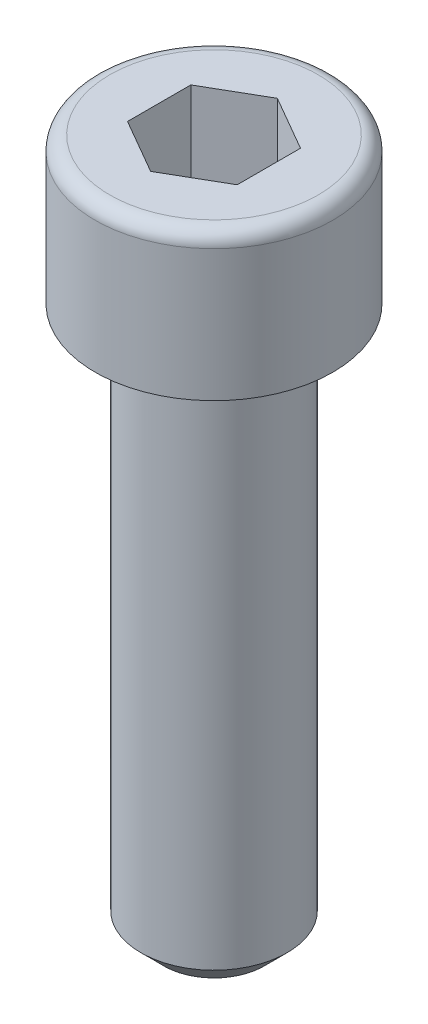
ISO-10303-21;
HEADER;
FILE_DESCRIPTION(('STEP AP214'),'2;1');
FILE_NAME('part.step','',(''),(''),'','','');
FILE_SCHEMA(('AUTOMOTIVE_DESIGN { 1 0 10303 214 1 1 1 1 }'));
ENDSEC;
DATA;
#1=APPLICATION_CONTEXT('core data for automotive mechanical design processes');
#2=APPLICATION_PROTOCOL_DEFINITION('international standard','automotive_design',2000,#1);
#3=PRODUCT_CONTEXT('',#1,'mechanical');
#4=PRODUCT('Part','Part','',(#3));
#5=PRODUCT_RELATED_PRODUCT_CATEGORY('part','',(#4));
#6=PRODUCT_DEFINITION_FORMATION('','',#4);
#7=PRODUCT_DEFINITION_CONTEXT('part definition',#1,'design');
#8=PRODUCT_DEFINITION('design','',#6,#7);
#9=PRODUCT_DEFINITION_SHAPE('','',#8);
#10=(LENGTH_UNIT() NAMED_UNIT(*) SI_UNIT(.MILLI.,.METRE.));
#11=(NAMED_UNIT(*) PLANE_ANGLE_UNIT() SI_UNIT($,.RADIAN.));
#12=(NAMED_UNIT(*) SI_UNIT($,.STERADIAN.) SOLID_ANGLE_UNIT());
#13=UNCERTAINTY_MEASURE_WITH_UNIT(LENGTH_MEASURE(1.E-05),#10,'distance_accuracy_value','');
#14=(GEOMETRIC_REPRESENTATION_CONTEXT(3) GLOBAL_UNCERTAINTY_ASSIGNED_CONTEXT((#13)) GLOBAL_UNIT_ASSIGNED_CONTEXT((#10,
#11,#12)) REPRESENTATION_CONTEXT('',''));
#15=CARTESIAN_POINT('',(0.,0.,0.));
#16=DIRECTION('',(0.,0.,1.));
#17=DIRECTION('',(1.,0.,0.));
#18=AXIS2_PLACEMENT_3D('',#15,#16,#17);
#19=CARTESIAN_POINT('',(2.75000000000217,-38.,1.17961196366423E-13));
#20=DIRECTION('',(0.,-1.,0.));
#21=DIRECTION('',(1.,0.,0.));
#22=AXIS2_PLACEMENT_3D('',#19,#20,#21);
#23=PLANE('',#22);
#24=CARTESIAN_POINT('',(2.05391259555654E-12,-38.,0.));
#25=DIRECTION('',(0.,1.,0.));
#26=DIRECTION('',(-1.,0.,0.));
#27=AXIS2_PLACEMENT_3D('',#24,#25,#26);
#28=CIRCLE('',#27,2.75);
#29=CARTESIAN_POINT('',(-2.74999999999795,-37.9999999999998,0.));
#30=VERTEX_POINT('',#29);
#31=EDGE_CURVE('E13',#30,#30,#28,.T.);
#32=ORIENTED_EDGE('',*,*,#31,.F.);
#33=EDGE_LOOP('',(#32));
#34=FACE_BOUND('',#33,.T.);
#35=ADVANCED_FACE('F356',(#34),#23,.T.);
#36=CARTESIAN_POINT('',(2.05391259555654E-12,-38.,0.));
#37=DIRECTION('',(0.,1.,0.));
#38=DIRECTION('',(-1.,0.,0.));
#39=AXIS2_PLACEMENT_3D('',#36,#37,#38);
#40=CONICAL_SURFACE('',#39,2.75,0.785398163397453);
#41=CARTESIAN_POINT('',(2.02615701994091E-12,-36.75,1.04083408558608E-13));
#42=DIRECTION('',(0.,1.,0.));
#43=DIRECTION('',(-1.,0.,0.));
#44=AXIS2_PLACEMENT_3D('',#41,#42,#43);
#45=CIRCLE('',#44,4.);
#46=CARTESIAN_POINT('',(-3.99999999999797,-36.7499999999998,1.04083408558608E-13));
#47=VERTEX_POINT('',#46);
#48=EDGE_CURVE('E363',#47,#47,#45,.T.);
#49=ORIENTED_EDGE('',*,*,#48,.F.);
#50=EDGE_LOOP('',(#49));
#51=FACE_BOUND('',#50,.T.);
#52=ORIENTED_EDGE('',*,*,#31,.T.);
#53=EDGE_LOOP('',(#52));
#54=FACE_BOUND('',#53,.T.);
#55=ADVANCED_FACE('F479',(#51,#54),#40,.T.);
#56=CARTESIAN_POINT('',(-3.91353616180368E-12,65.1172922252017,-9.57567358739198E-13));
#57=DIRECTION('',(0.,1.,0.));
#58=DIRECTION('',(-1.,0.,0.));
#59=AXIS2_PLACEMENT_3D('',#56,#57,#58);
#60=CYLINDRICAL_SURFACE('',#59,3.99999999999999);
#61=ORIENTED_EDGE('',*,*,#48,.T.);
#62=EDGE_LOOP('',(#61));
#63=FACE_BOUND('',#62,.T.);
#64=CARTESIAN_POINT('',(2.77555756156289E-13,-8.,0.));
#65=DIRECTION('',(0.,1.,0.));
#66=DIRECTION('',(-1.,0.,0.));
#67=AXIS2_PLACEMENT_3D('',#64,#65,#66);
#68=CIRCLE('',#67,3.99999999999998);
#69=CARTESIAN_POINT('',(-3.9999999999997,-7.99999999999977,0.));
#70=VERTEX_POINT('',#69);
#71=EDGE_CURVE('E471',#70,#70,#68,.T.);
#72=ORIENTED_EDGE('',*,*,#71,.F.);
#73=EDGE_LOOP('',(#72));
#74=FACE_BOUND('',#73,.T.);
#75=ADVANCED_FACE('F476',(#63,#74),#60,.T.);
#76=CARTESIAN_POINT('',(4.0000000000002,-8.00000000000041,0.));
#77=DIRECTION('',(0.,1.,0.));
#78=DIRECTION('',(-1.,0.,0.));
#79=AXIS2_PLACEMENT_3D('',#76,#77,#78);
#80=PLANE('',#79);
#81=CARTESIAN_POINT('',(2.77555756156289E-13,-8.,0.));
#82=DIRECTION('',(0.,1.,0.));
#83=DIRECTION('',(-1.,0.,0.));
#84=AXIS2_PLACEMENT_3D('',#81,#82,#83);
#85=CIRCLE('',#84,6.49999999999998);
#86=CARTESIAN_POINT('',(-6.49999999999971,-7.99999999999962,0.));
#87=VERTEX_POINT('',#86);
#88=EDGE_CURVE('E468',#87,#87,#85,.T.);
#89=ORIENTED_EDGE('',*,*,#88,.F.);
#90=EDGE_LOOP('',(#89));
#91=FACE_BOUND('',#90,.T.);
#92=ORIENTED_EDGE('',*,*,#71,.T.);
#93=EDGE_LOOP('',(#92));
#94=FACE_BOUND('',#93,.T.);
#95=ADVANCED_FACE('F493',(#91,#94),#80,.F.);
#96=CARTESIAN_POINT('',(-3.91353616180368E-12,65.1172922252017,-9.57567358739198E-13));
#97=DIRECTION('',(0.,1.,0.));
#98=DIRECTION('',(-1.,0.,0.));
#99=AXIS2_PLACEMENT_3D('',#96,#97,#98);
#100=CYLINDRICAL_SURFACE('',#99,6.49999999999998);
#101=CARTESIAN_POINT('',(2.22044604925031E-13,-0.8,0.));
#102=DIRECTION('',(0.,1.,0.));
#103=DIRECTION('',(-1.,0.,0.));
#104=AXIS2_PLACEMENT_3D('',#101,#102,#103);
#105=CIRCLE('',#104,6.49999999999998);
#106=CARTESIAN_POINT('',(-6.49999999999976,-0.799999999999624,0.));
#107=VERTEX_POINT('',#106);
#108=EDGE_CURVE('E465',#107,#107,#105,.T.);
#109=ORIENTED_EDGE('',*,*,#108,.F.);
#110=EDGE_LOOP('',(#109));
#111=FACE_BOUND('',#110,.T.);
#112=ORIENTED_EDGE('',*,*,#88,.T.);
#113=EDGE_LOOP('',(#112));
#114=FACE_BOUND('',#113,.T.);
#115=ADVANCED_FACE('F498',(#111,#114),#100,.T.);
#116=CARTESIAN_POINT('',(2.22044604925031E-13,-0.8,0.));
#117=DIRECTION('',(0.,1.,0.));
#118=DIRECTION('',(-1.,0.,0.));
#119=AXIS2_PLACEMENT_3D('',#116,#117,#118);
#120=TOROIDAL_SURFACE('',#119,5.69999999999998,0.8);
#121=CARTESIAN_POINT('',(2.22044604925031E-13,0.,0.));
#122=DIRECTION('',(0.,1.,0.));
#123=DIRECTION('',(-1.,0.,0.));
#124=AXIS2_PLACEMENT_3D('',#121,#122,#123);
#125=CIRCLE('',#124,5.69999999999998);
#126=CARTESIAN_POINT('',(-5.69999999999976,3.30203001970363E-13,0.));
#127=VERTEX_POINT('',#126);
#128=EDGE_CURVE('E456',#127,#127,#125,.T.);
#129=ORIENTED_EDGE('',*,*,#128,.F.);
#130=EDGE_LOOP('',(#129));
#131=FACE_BOUND('',#130,.T.);
#132=ORIENTED_EDGE('',*,*,#108,.T.);
#133=EDGE_LOOP('',(#132));
#134=FACE_BOUND('',#133,.T.);
#135=ADVANCED_FACE('F504',(#131,#134),#120,.T.);
#136=CARTESIAN_POINT('',(5.70000000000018,-4.11129463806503E-13,0.));
#137=DIRECTION('',(0.,-1.,0.));
#138=DIRECTION('',(1.,0.,0.));
#139=AXIS2_PLACEMENT_3D('',#136,#137,#138);
#140=PLANE('',#139);
#141=DIRECTION('',(0.,0.,1.));
#142=VECTOR('',#141,1.);
#143=CARTESIAN_POINT('',(-2.99999999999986,3.64291929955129E-13,-1.73205080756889));
#144=LINE('',#143,#142);
#145=CARTESIAN_POINT('',(-2.99999999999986,3.62557206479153E-13,-1.73205080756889));
#146=VERTEX_POINT('',#145);
#147=CARTESIAN_POINT('',(-2.99999999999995,0.,1.73205080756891));
#148=VERTEX_POINT('',#147);
#149=EDGE_CURVE('E433',#146,#148,#144,.T.);
#150=ORIENTED_EDGE('',*,*,#149,.F.);
#151=DIRECTION('',(-0.866025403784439,0.,0.5));
#152=VECTOR('',#151,1.);
#153=CARTESIAN_POINT('',(0.,0.,-3.46410161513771));
#154=LINE('',#153,#152);
#155=CARTESIAN_POINT('',(0.,0.,-3.46410161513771));
#156=VERTEX_POINT('',#155);
#157=EDGE_CURVE('E370',#156,#146,#154,.T.);
#158=ORIENTED_EDGE('',*,*,#157,.F.);
#159=DIRECTION('',(0.866025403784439,0.,0.5));
#160=VECTOR('',#159,1.);
#161=CARTESIAN_POINT('',(0.,0.,-3.46410161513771));
#162=LINE('',#161,#160);
#163=CARTESIAN_POINT('',(3.00000000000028,0.,-1.7320508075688));
#164=VERTEX_POINT('',#163);
#165=EDGE_CURVE('E603',#156,#164,#162,.T.);
#166=ORIENTED_EDGE('',*,*,#165,.T.);
#167=DIRECTION('',(0.,0.,1.));
#168=VECTOR('',#167,1.);
#169=CARTESIAN_POINT('',(3.00000000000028,0.,-1.7320508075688));
#170=LINE('',#169,#168);
#171=CARTESIAN_POINT('',(3.00000000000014,-4.11129463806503E-13,1.73205080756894));
#172=VERTEX_POINT('',#171);
#173=EDGE_CURVE('E600',#164,#172,#170,.T.);
#174=ORIENTED_EDGE('',*,*,#173,.T.);
#175=DIRECTION('',(-0.866025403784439,0.,0.5));
#176=VECTOR('',#175,1.);
#177=CARTESIAN_POINT('',(3.00000000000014,-4.11129463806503E-13,1.73205080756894));
#178=LINE('',#177,#176);
#179=CARTESIAN_POINT('',(4.02455846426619E-13,0.,3.46410161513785));
#180=VERTEX_POINT('',#179);
#181=EDGE_CURVE('E597',#172,#180,#178,.T.);
#182=ORIENTED_EDGE('',*,*,#181,.T.);
#183=DIRECTION('',(0.86602540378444,0.,0.500000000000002));
#184=VECTOR('',#183,1.);
#185=CARTESIAN_POINT('',(-2.99999999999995,0.,1.73205080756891));
#186=LINE('',#185,#184);
#187=EDGE_CURVE('E595',#148,#180,#186,.T.);
#188=ORIENTED_EDGE('',*,*,#187,.F.);
#189=EDGE_LOOP('',(#150,#158,#166,#174,#182,#188));
#190=FACE_BOUND('',#189,.T.);
#191=ORIENTED_EDGE('',*,*,#128,.T.);
#192=EDGE_LOOP('',(#191));
#193=FACE_BOUND('',#192,.T.);
#194=ADVANCED_FACE('F510',(#190,#193),#140,.F.);
#195=CARTESIAN_POINT('',(2.63677968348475E-13,-5.75999999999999,-3.46410161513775));
#196=DIRECTION('',(-0.5,0.,-0.866025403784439));
#197=DIRECTION('',(-0.866025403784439,0.,0.5));
#198=AXIS2_PLACEMENT_3D('',#195,#196,#197);
#199=PLANE('',#198);
#200=ORIENTED_EDGE('',*,*,#157,.T.);
#201=DIRECTION('',(0.,1.,0.));
#202=VECTOR('',#201,1.);
#203=CARTESIAN_POINT('',(-2.99999999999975,-5.75999999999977,-1.73205080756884));
#204=LINE('',#203,#202);
#205=CARTESIAN_POINT('',(-2.99999999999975,-5.75999999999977,-1.73205080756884));
#206=VERTEX_POINT('',#205);
#207=EDGE_CURVE('E438',#206,#146,#204,.T.);
#208=ORIENTED_EDGE('',*,*,#207,.F.);
#209=DIRECTION('',(-0.866025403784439,0.,0.5));
#210=VECTOR('',#209,1.);
#211=CARTESIAN_POINT('',(2.63677968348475E-13,-5.75999999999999,-3.46410161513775));
#212=LINE('',#211,#210);
#213=CARTESIAN_POINT('',(2.63677968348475E-13,-5.75999999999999,-3.46410161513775));
#214=VERTEX_POINT('',#213);
#215=EDGE_CURVE('E427',#214,#206,#212,.T.);
#216=ORIENTED_EDGE('',*,*,#215,.F.);
#217=DIRECTION('',(0.,1.,0.));
#218=VECTOR('',#217,1.);
#219=CARTESIAN_POINT('',(2.63677968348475E-13,-5.75999999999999,-3.46410161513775));
#220=LINE('',#219,#218);
#221=EDGE_CURVE('E454',#214,#156,#220,.T.);
#222=ORIENTED_EDGE('',*,*,#221,.T.);
#223=EDGE_LOOP('',(#200,#208,#216,#222));
#224=FACE_BOUND('',#223,.T.);
#225=ADVANCED_FACE('F516',(#224),#199,.F.);
#226=CARTESIAN_POINT('',(2.63677968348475E-13,-5.75999999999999,-3.46410161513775));
#227=DIRECTION('',(-0.499999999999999,0.,0.866025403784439));
#228=DIRECTION('',(0.866025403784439,0.,0.5));
#229=AXIS2_PLACEMENT_3D('',#226,#227,#228);
#230=PLANE('',#229);
#231=ORIENTED_EDGE('',*,*,#165,.F.);
#232=ORIENTED_EDGE('',*,*,#221,.F.);
#233=DIRECTION('',(0.866025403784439,0.,0.5));
#234=VECTOR('',#233,1.);
#235=CARTESIAN_POINT('',(2.63677968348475E-13,-5.75999999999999,-3.46410161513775));
#236=LINE('',#235,#234);
#237=CARTESIAN_POINT('',(3.00000000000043,-5.7600000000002,-1.73205080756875));
#238=VERTEX_POINT('',#237);
#239=EDGE_CURVE('E451',#214,#238,#236,.T.);
#240=ORIENTED_EDGE('',*,*,#239,.T.);
#241=DIRECTION('',(0.,1.,0.));
#242=VECTOR('',#241,1.);
#243=CARTESIAN_POINT('',(3.00000000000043,-5.7600000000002,-1.73205080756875));
#244=LINE('',#243,#242);
#245=EDGE_CURVE('E457',#238,#164,#244,.T.);
#246=ORIENTED_EDGE('',*,*,#245,.T.);
#247=EDGE_LOOP('',(#231,#232,#240,#246));
#248=FACE_BOUND('',#247,.T.);
#249=ADVANCED_FACE('F522',(#248),#230,.T.);
#250=CARTESIAN_POINT('',(3.00000000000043,-5.7600000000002,-1.73205080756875));
#251=DIRECTION('',(-1.,0.,0.));
#252=DIRECTION('',(0.,-1.,0.));
#253=AXIS2_PLACEMENT_3D('',#250,#251,#252);
#254=PLANE('',#253);
#255=ORIENTED_EDGE('',*,*,#173,.F.);
#256=ORIENTED_EDGE('',*,*,#245,.F.);
#257=DIRECTION('',(0.,0.,1.));
#258=VECTOR('',#257,1.);
#259=CARTESIAN_POINT('',(3.00000000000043,-5.7600000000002,-1.73205080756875));
#260=LINE('',#259,#258);
#261=CARTESIAN_POINT('',(3.00000000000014,-5.76000000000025,1.73205080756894));
#262=VERTEX_POINT('',#261);
#263=EDGE_CURVE('E445',#238,#262,#260,.T.);
#264=ORIENTED_EDGE('',*,*,#263,.T.);
#265=DIRECTION('',(0.,1.,0.));
#266=VECTOR('',#265,1.);
#267=CARTESIAN_POINT('',(3.00000000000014,-5.76000000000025,1.73205080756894));
#268=LINE('',#267,#266);
#269=EDGE_CURVE('E459',#262,#172,#268,.T.);
#270=ORIENTED_EDGE('',*,*,#269,.T.);
#271=EDGE_LOOP('',(#255,#256,#264,#270));
#272=FACE_BOUND('',#271,.T.);
#273=ADVANCED_FACE('F527',(#272),#254,.T.);
#274=CARTESIAN_POINT('',(3.00000000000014,-5.76000000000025,1.73205080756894));
#275=DIRECTION('',(-0.500000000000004,0.,-0.866025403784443));
#276=DIRECTION('',(-0.866025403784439,0.,0.5));
#277=AXIS2_PLACEMENT_3D('',#274,#275,#276);
#278=PLANE('',#277);
#279=ORIENTED_EDGE('',*,*,#181,.F.);
#280=ORIENTED_EDGE('',*,*,#269,.F.);
#281=DIRECTION('',(-0.866025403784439,0.,0.5));
#282=VECTOR('',#281,1.);
#283=CARTESIAN_POINT('',(3.00000000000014,-5.76000000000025,1.73205080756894));
#284=LINE('',#283,#282);
#285=CARTESIAN_POINT('',(4.85722573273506E-13,-5.76000000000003,3.46410161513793));
#286=VERTEX_POINT('',#285);
#287=EDGE_CURVE('E442',#262,#286,#284,.T.);
#288=ORIENTED_EDGE('',*,*,#287,.T.);
#289=DIRECTION('',(0.,1.,0.));
#290=VECTOR('',#289,1.);
#291=CARTESIAN_POINT('',(4.85722573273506E-13,-5.76000000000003,3.46410161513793));
#292=LINE('',#291,#290);
#293=EDGE_CURVE('E437',#286,#180,#292,.T.);
#294=ORIENTED_EDGE('',*,*,#293,.T.);
#295=EDGE_LOOP('',(#279,#280,#288,#294));
#296=FACE_BOUND('',#295,.T.);
#297=ADVANCED_FACE('F533',(#296),#278,.T.);
#298=CARTESIAN_POINT('',(-2.99999999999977,-5.75999999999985,1.73205080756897));
#299=DIRECTION('',(-0.499999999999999,0.,0.866025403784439));
#300=DIRECTION('',(0.86602540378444,0.,0.500000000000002));
#301=AXIS2_PLACEMENT_3D('',#298,#299,#300);
#302=PLANE('',#301);
#303=ORIENTED_EDGE('',*,*,#187,.T.);
#304=ORIENTED_EDGE('',*,*,#293,.F.);
#305=DIRECTION('',(0.86602540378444,0.,0.500000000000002));
#306=VECTOR('',#305,1.);
#307=CARTESIAN_POINT('',(-2.99999999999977,-5.75999999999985,1.73205080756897));
#308=LINE('',#307,#306);
#309=CARTESIAN_POINT('',(-2.99999999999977,-5.75999999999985,1.73205080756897));
#310=VERTEX_POINT('',#309);
#311=EDGE_CURVE('E378',#310,#286,#308,.T.);
#312=ORIENTED_EDGE('',*,*,#311,.F.);
#313=DIRECTION('',(0.,1.,0.));
#314=VECTOR('',#313,1.);
#315=CARTESIAN_POINT('',(-2.99999999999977,-5.75999999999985,1.73205080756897));
#316=LINE('',#315,#314);
#317=EDGE_CURVE('E430',#310,#148,#316,.T.);
#318=ORIENTED_EDGE('',*,*,#317,.T.);
#319=EDGE_LOOP('',(#303,#304,#312,#318));
#320=FACE_BOUND('',#319,.T.);
#321=ADVANCED_FACE('F441',(#320),#302,.F.);
#322=CARTESIAN_POINT('',(-2.99999999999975,-5.75999999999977,-1.73205080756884));
#323=DIRECTION('',(-1.,0.,0.));
#324=DIRECTION('',(0.,-1.,0.));
#325=AXIS2_PLACEMENT_3D('',#322,#323,#324);
#326=PLANE('',#325);
#327=ORIENTED_EDGE('',*,*,#149,.T.);
#328=ORIENTED_EDGE('',*,*,#317,.F.);
#329=DIRECTION('',(0.,0.,1.));
#330=VECTOR('',#329,1.);
#331=CARTESIAN_POINT('',(-2.99999999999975,-5.75999999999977,-1.73205080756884));
#332=LINE('',#331,#330);
#333=EDGE_CURVE('E420',#206,#310,#332,.T.);
#334=ORIENTED_EDGE('',*,*,#333,.F.);
#335=ORIENTED_EDGE('',*,*,#207,.T.);
#336=EDGE_LOOP('',(#327,#328,#334,#335));
#337=FACE_BOUND('',#336,.T.);
#338=ADVANCED_FACE('F431',(#337),#326,.F.);
#339=CARTESIAN_POINT('',(-2.99999999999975,-5.75999999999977,-1.73205080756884));
#340=DIRECTION('',(0.104319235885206,0.977992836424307,0.180686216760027));
#341=DIRECTION('',(0.,-0.181677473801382,0.983358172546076));
#342=AXIS2_PLACEMENT_3D('',#339,#340,#341);
#343=PLANE('',#342);
#344=DIRECTION('',(-0.85161315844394,0.181677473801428,-0.491679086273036));
#345=VECTOR('',#344,1.);
#346=CARTESIAN_POINT('',(2.77555756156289E-13,-6.40000000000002,0.));
#347=LINE('',#346,#345);
#348=CARTESIAN_POINT('',(2.77555756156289E-13,-6.40000000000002,0.));
#349=VERTEX_POINT('',#348);
#350=EDGE_CURVE('E424',#349,#206,#347,.T.);
#351=ORIENTED_EDGE('',*,*,#350,.F.);
#352=DIRECTION('',(0.,0.181677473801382,-0.983358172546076));
#353=VECTOR('',#352,1.);
#354=CARTESIAN_POINT('',(2.77555756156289E-13,-6.40000000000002,0.));
#355=LINE('',#354,#353);
#356=EDGE_CURVE('E584',#349,#214,#355,.T.);
#357=ORIENTED_EDGE('',*,*,#356,.T.);
#358=ORIENTED_EDGE('',*,*,#215,.T.);
#359=EDGE_LOOP('',(#351,#357,#358));
#360=FACE_BOUND('',#359,.T.);
#361=ADVANCED_FACE('F548',(#360),#343,.T.);
#362=CARTESIAN_POINT('',(2.63677968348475E-13,-5.75999999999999,-3.46410161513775));
#363=DIRECTION('',(-0.104319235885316,0.977992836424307,0.180686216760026));
#364=DIRECTION('',(0.,-0.181677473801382,0.983358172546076));
#365=AXIS2_PLACEMENT_3D('',#362,#363,#364);
#366=PLANE('',#365);
#367=ORIENTED_EDGE('',*,*,#356,.F.);
#368=DIRECTION('',(0.851613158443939,0.181677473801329,-0.491679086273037));
#369=VECTOR('',#368,1.);
#370=CARTESIAN_POINT('',(2.77555756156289E-13,-6.40000000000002,0.));
#371=LINE('',#370,#369);
#372=EDGE_CURVE('E416',#349,#238,#371,.T.);
#373=ORIENTED_EDGE('',*,*,#372,.T.);
#374=ORIENTED_EDGE('',*,*,#239,.F.);
#375=EDGE_LOOP('',(#367,#373,#374));
#376=FACE_BOUND('',#375,.T.);
#377=ADVANCED_FACE('F554',(#376),#366,.T.);
#378=CARTESIAN_POINT('',(-2.99999999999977,-5.75999999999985,1.73205080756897));
#379=DIRECTION('',(0.208638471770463,0.977992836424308,0.));
#380=DIRECTION('',(-0.977992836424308,0.208638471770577,0.));
#381=AXIS2_PLACEMENT_3D('',#378,#379,#380);
#382=PLANE('',#381);
#383=DIRECTION('',(-0.85161315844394,0.18167747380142,0.491679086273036));
#384=VECTOR('',#383,1.);
#385=CARTESIAN_POINT('',(2.77555756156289E-13,-6.40000000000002,0.));
#386=LINE('',#385,#384);
#387=EDGE_CURVE('E410',#349,#310,#386,.T.);
#388=ORIENTED_EDGE('',*,*,#387,.F.);
#389=ORIENTED_EDGE('',*,*,#350,.T.);
#390=ORIENTED_EDGE('',*,*,#333,.T.);
#391=EDGE_LOOP('',(#388,#389,#390));
#392=FACE_BOUND('',#391,.T.);
#393=ADVANCED_FACE('F422',(#392),#382,.T.);
#394=CARTESIAN_POINT('',(3.00000000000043,-5.7600000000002,-1.73205080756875));
#395=DIRECTION('',(-0.208638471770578,0.977992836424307,0.));
#396=DIRECTION('',(-0.977992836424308,-0.208638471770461,0.));
#397=AXIS2_PLACEMENT_3D('',#394,#395,#396);
#398=PLANE('',#397);
#399=ORIENTED_EDGE('',*,*,#372,.F.);
#400=DIRECTION('',(0.85161315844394,0.18167747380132,0.491679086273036));
#401=VECTOR('',#400,1.);
#402=CARTESIAN_POINT('',(2.77555756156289E-13,-6.40000000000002,0.));
#403=LINE('',#402,#401);
#404=EDGE_CURVE('E417',#349,#262,#403,.T.);
#405=ORIENTED_EDGE('',*,*,#404,.T.);
#406=ORIENTED_EDGE('',*,*,#263,.F.);
#407=EDGE_LOOP('',(#399,#405,#406));
#408=FACE_BOUND('',#407,.T.);
#409=ADVANCED_FACE('F565',(#408),#398,.T.);
#410=CARTESIAN_POINT('',(4.85722573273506E-13,-5.76000000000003,3.46410161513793));
#411=DIRECTION('',(0.104319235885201,0.977992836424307,-0.180686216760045));
#412=DIRECTION('',(0.,0.181677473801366,0.983358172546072));
#413=AXIS2_PLACEMENT_3D('',#410,#411,#412);
#414=PLANE('',#413);
#415=DIRECTION('',(0.,0.181677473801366,0.983358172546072));
#416=VECTOR('',#415,1.);
#417=CARTESIAN_POINT('',(2.77555756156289E-13,-6.40000000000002,0.));
#418=LINE('',#417,#416);
#419=EDGE_CURVE('E413',#349,#286,#418,.T.);
#420=ORIENTED_EDGE('',*,*,#419,.F.);
#421=ORIENTED_EDGE('',*,*,#387,.T.);
#422=ORIENTED_EDGE('',*,*,#311,.T.);
#423=EDGE_LOOP('',(#420,#421,#422));
#424=FACE_BOUND('',#423,.T.);
#425=ADVANCED_FACE('F412',(#424),#414,.T.);
#426=CARTESIAN_POINT('',(3.00000000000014,-5.76000000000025,1.73205080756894));
#427=DIRECTION('',(-0.104319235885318,0.977992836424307,-0.180686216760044));
#428=DIRECTION('',(0.,0.181677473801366,0.983358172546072));
#429=AXIS2_PLACEMENT_3D('',#426,#427,#428);
#430=PLANE('',#429);
#431=ORIENTED_EDGE('',*,*,#404,.F.);
#432=ORIENTED_EDGE('',*,*,#419,.T.);
#433=ORIENTED_EDGE('',*,*,#287,.F.);
#434=EDGE_LOOP('',(#431,#432,#433));
#435=FACE_BOUND('',#434,.T.);
#436=ADVANCED_FACE('F550',(#435),#430,.T.);
#437=CLOSED_SHELL('',(#35,#55,#75,#95,#115,#135,#194,#225,#249,#273,#297,#321,#338,#361,#377,
#393,#409,#425,#436));
#438=MANIFOLD_SOLID_BREP('B2',#437);
#439=ADVANCED_BREP_SHAPE_REPRESENTATION('',(#18,#438),#14);
#440=SHAPE_DEFINITION_REPRESENTATION(#9,#439);
ENDSEC;
END-ISO-10303-21;
